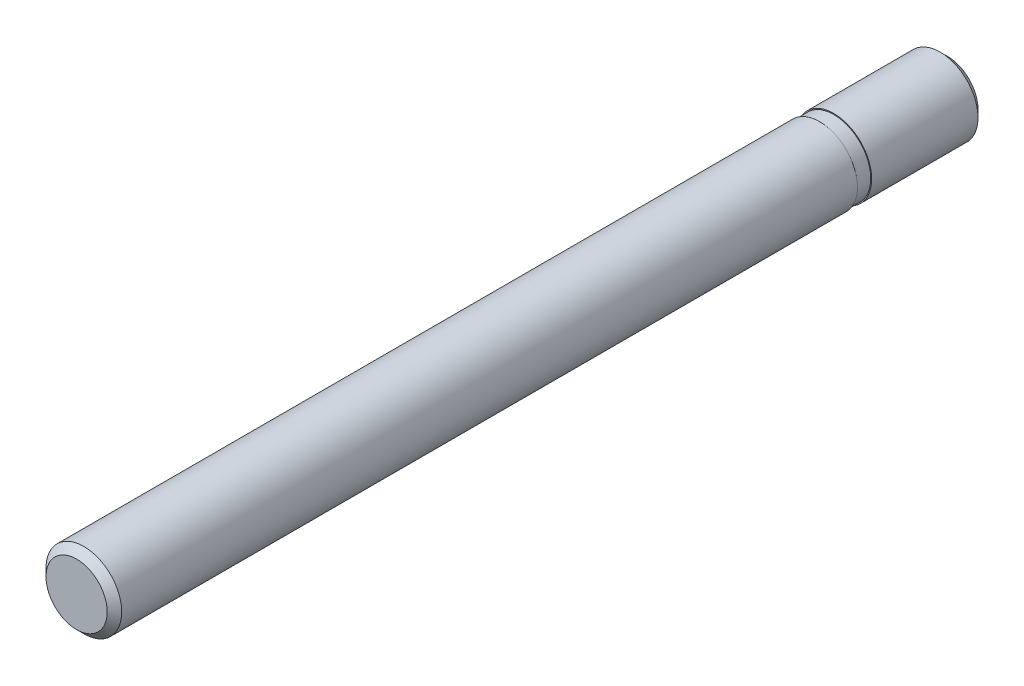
ISO-10303-21;
HEADER;
FILE_DESCRIPTION(('STEP AP214'),'2;1');
FILE_NAME('part.step','',(''),(''),'','','');
FILE_SCHEMA(('AUTOMOTIVE_DESIGN { 1 0 10303 214 1 1 1 1 }'));
ENDSEC;
DATA;
#1=APPLICATION_CONTEXT('core data for automotive mechanical design processes');
#2=APPLICATION_PROTOCOL_DEFINITION('international standard','automotive_design',2000,#1);
#3=PRODUCT_CONTEXT('',#1,'mechanical');
#4=PRODUCT('Part','Part','',(#3));
#5=PRODUCT_RELATED_PRODUCT_CATEGORY('part','',(#4));
#6=PRODUCT_DEFINITION_FORMATION('','',#4);
#7=PRODUCT_DEFINITION_CONTEXT('part definition',#1,'design');
#8=PRODUCT_DEFINITION('design','',#6,#7);
#9=PRODUCT_DEFINITION_SHAPE('','',#8);
#10=(LENGTH_UNIT() NAMED_UNIT(*) SI_UNIT(.MILLI.,.METRE.));
#11=(NAMED_UNIT(*) PLANE_ANGLE_UNIT() SI_UNIT($,.RADIAN.));
#12=(NAMED_UNIT(*) SI_UNIT($,.STERADIAN.) SOLID_ANGLE_UNIT());
#13=UNCERTAINTY_MEASURE_WITH_UNIT(LENGTH_MEASURE(1.E-05),#10,'distance_accuracy_value','');
#14=(GEOMETRIC_REPRESENTATION_CONTEXT(3) GLOBAL_UNCERTAINTY_ASSIGNED_CONTEXT((#13)) GLOBAL_UNIT_ASSIGNED_CONTEXT((#10,
#11,#12)) REPRESENTATION_CONTEXT('',''));
#15=CARTESIAN_POINT('',(0.,0.,0.));
#16=DIRECTION('',(0.,0.,1.));
#17=DIRECTION('',(1.,0.,0.));
#18=AXIS2_PLACEMENT_3D('',#15,#16,#17);
#19=CARTESIAN_POINT('',(0.,1.6165,-12.));
#20=DIRECTION('',(0.,0.,-1.));
#21=DIRECTION('',(-1.,0.,0.));
#22=AXIS2_PLACEMENT_3D('',#19,#20,#21);
#23=PLANE('',#22);
#24=CARTESIAN_POINT('',(0.,0.,-12.0000000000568));
#25=DIRECTION('',(0.,0.,1.));
#26=DIRECTION('',(1.,0.,0.));
#27=AXIS2_PLACEMENT_3D('',#24,#25,#26);
#28=CIRCLE('',#27,3.23300000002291);
#29=CARTESIAN_POINT('',(3.23300000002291,0.,-12.0000000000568));
#30=VERTEX_POINT('',#29);
#31=EDGE_CURVE('E19',#30,#30,#28,.T.);
#32=ORIENTED_EDGE('',*,*,#31,.F.);
#33=EDGE_LOOP('',(#32));
#34=FACE_BOUND('',#33,.T.);
#35=ADVANCED_FACE('F12',(#34),#23,.T.);
#36=CARTESIAN_POINT('',(0.,0.,-11.2330000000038));
#37=DIRECTION('',(0.,0.,1.));
#38=DIRECTION('',(1.,0.,0.));
#39=AXIS2_PLACEMENT_3D('',#36,#37,#38);
#40=CONICAL_SURFACE('',#39,4.00000000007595,0.785398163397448);
#41=CARTESIAN_POINT('',(0.,0.,-11.233));
#42=DIRECTION('',(0.,0.,1.));
#43=DIRECTION('',(1.,0.,0.));
#44=AXIS2_PLACEMENT_3D('',#41,#42,#43);
#45=CIRCLE('',#44,4.);
#46=CARTESIAN_POINT('',(4.,0.,-11.233));
#47=VERTEX_POINT('',#46);
#48=EDGE_CURVE('E23',#47,#47,#45,.T.);
#49=ORIENTED_EDGE('',*,*,#48,.F.);
#50=EDGE_LOOP('',(#49));
#51=FACE_BOUND('',#50,.T.);
#52=ORIENTED_EDGE('',*,*,#31,.T.);
#53=EDGE_LOOP('',(#52));
#54=FACE_BOUND('',#53,.T.);
#55=ADVANCED_FACE('F66',(#51,#54),#40,.T.);
#56=CARTESIAN_POINT('',(0.,0.,4.75));
#57=DIRECTION('',(0.,0.,1.));
#58=DIRECTION('',(1.,0.,0.));
#59=AXIS2_PLACEMENT_3D('',#56,#57,#58);
#60=CYLINDRICAL_SURFACE('',#59,4.);
#61=CARTESIAN_POINT('',(0.,0.,0.));
#62=DIRECTION('',(0.,0.,1.));
#63=DIRECTION('',(1.,0.,0.));
#64=AXIS2_PLACEMENT_3D('',#61,#62,#63);
#65=CIRCLE('',#64,4.);
#66=CARTESIAN_POINT('',(4.,0.,0.));
#67=VERTEX_POINT('',#66);
#68=EDGE_CURVE('E28',#67,#67,#65,.T.);
#69=ORIENTED_EDGE('',*,*,#68,.F.);
#70=EDGE_LOOP('',(#69));
#71=FACE_BOUND('',#70,.T.);
#72=ORIENTED_EDGE('',*,*,#48,.T.);
#73=EDGE_LOOP('',(#72));
#74=FACE_BOUND('',#73,.T.);
#75=ADVANCED_FACE('F72',(#71,#74),#60,.T.);
#76=CARTESIAN_POINT('',(0.,0.,0.));
#77=DIRECTION('',(0.,0.,1.));
#78=DIRECTION('',(1.,0.,0.));
#79=AXIS2_PLACEMENT_3D('',#76,#77,#78);
#80=PLANE('',#79);
#81=CARTESIAN_POINT('',(0.,0.,0.));
#82=DIRECTION('',(0.,0.,1.));
#83=DIRECTION('',(1.,0.,0.));
#84=AXIS2_PLACEMENT_3D('',#81,#82,#83);
#85=CIRCLE('',#84,3.9);
#86=CARTESIAN_POINT('',(3.9,0.,0.));
#87=VERTEX_POINT('',#86);
#88=EDGE_CURVE('E8',#87,#87,#85,.T.);
#89=ORIENTED_EDGE('',*,*,#88,.F.);
#90=EDGE_LOOP('',(#89));
#91=FACE_BOUND('',#90,.T.);
#92=ORIENTED_EDGE('',*,*,#68,.T.);
#93=EDGE_LOOP('',(#92));
#94=FACE_BOUND('',#93,.T.);
#95=ADVANCED_FACE('F77',(#91,#94),#80,.T.);
#96=CARTESIAN_POINT('',(0.,0.,-2.6671715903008));
#97=DIRECTION('',(0.,0.,-1.));
#98=DIRECTION('',(-1.,0.,0.));
#99=AXIS2_PLACEMENT_3D('',#96,#97,#98);
#100=CYLINDRICAL_SURFACE('',#99,3.9);
#101=CARTESIAN_POINT('',(0.,0.,1.5));
#102=DIRECTION('',(0.,0.,-1.));
#103=DIRECTION('',(-1.,0.,0.));
#104=AXIS2_PLACEMENT_3D('',#101,#102,#103);
#105=CIRCLE('',#104,3.9);
#106=CARTESIAN_POINT('',(-3.9,0.,1.5));
#107=VERTEX_POINT('',#106);
#108=EDGE_CURVE('E44',#107,#107,#105,.T.);
#109=ORIENTED_EDGE('',*,*,#108,.T.);
#110=EDGE_LOOP('',(#109));
#111=FACE_BOUND('',#110,.T.);
#112=ORIENTED_EDGE('',*,*,#88,.T.);
#113=EDGE_LOOP('',(#112));
#114=FACE_BOUND('',#113,.T.);
#115=ADVANCED_FACE('F51',(#111,#114),#100,.T.);
#116=CARTESIAN_POINT('',(0.,0.,80.));
#117=DIRECTION('',(0.,0.,1.));
#118=DIRECTION('',(1.,0.,0.));
#119=AXIS2_PLACEMENT_3D('',#116,#117,#118);
#120=PLANE('',#119);
#121=CARTESIAN_POINT('',(0.,0.,80.));
#122=DIRECTION('',(0.,0.,1.));
#123=DIRECTION('',(1.,0.,0.));
#124=AXIS2_PLACEMENT_3D('',#121,#122,#123);
#125=CIRCLE('',#124,3.233);
#126=CARTESIAN_POINT('',(3.233,0.,80.));
#127=VERTEX_POINT('',#126);
#128=EDGE_CURVE('E40',#127,#127,#125,.T.);
#129=ORIENTED_EDGE('',*,*,#128,.T.);
#130=EDGE_LOOP('',(#129));
#131=FACE_BOUND('',#130,.T.);
#132=ADVANCED_FACE('F85',(#131),#120,.T.);
#133=CARTESIAN_POINT('',(0.,0.,80.));
#134=DIRECTION('',(0.,0.,-1.));
#135=DIRECTION('',(-1.,0.,0.));
#136=AXIS2_PLACEMENT_3D('',#133,#134,#135);
#137=CONICAL_SURFACE('',#136,3.233,0.785398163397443);
#138=CARTESIAN_POINT('',(0.,0.,79.233));
#139=DIRECTION('',(0.,0.,1.));
#140=DIRECTION('',(1.,0.,0.));
#141=AXIS2_PLACEMENT_3D('',#138,#139,#140);
#142=CIRCLE('',#141,4.);
#143=CARTESIAN_POINT('',(4.,0.,79.233));
#144=VERTEX_POINT('',#143);
#145=EDGE_CURVE('E31',#144,#144,#142,.F.);
#146=ORIENTED_EDGE('',*,*,#145,.F.);
#147=EDGE_LOOP('',(#146));
#148=FACE_BOUND('',#147,.T.);
#149=ORIENTED_EDGE('',*,*,#128,.F.);
#150=EDGE_LOOP('',(#149));
#151=FACE_BOUND('',#150,.T.);
#152=ADVANCED_FACE('F62',(#148,#151),#137,.T.);
#153=CARTESIAN_POINT('',(0.,0.,4.75));
#154=DIRECTION('',(0.,0.,1.));
#155=DIRECTION('',(1.,0.,0.));
#156=AXIS2_PLACEMENT_3D('',#153,#154,#155);
#157=CYLINDRICAL_SURFACE('',#156,4.);
#158=CARTESIAN_POINT('',(0.,0.,1.5));
#159=DIRECTION('',(0.,0.,1.));
#160=DIRECTION('',(1.,0.,0.));
#161=AXIS2_PLACEMENT_3D('',#158,#159,#160);
#162=CIRCLE('',#161,4.);
#163=CARTESIAN_POINT('',(4.,0.,1.5));
#164=VERTEX_POINT('',#163);
#165=EDGE_CURVE('E35',#164,#164,#162,.T.);
#166=ORIENTED_EDGE('',*,*,#165,.T.);
#167=EDGE_LOOP('',(#166));
#168=FACE_BOUND('',#167,.T.);
#169=ORIENTED_EDGE('',*,*,#145,.T.);
#170=EDGE_LOOP('',(#169));
#171=FACE_BOUND('',#170,.T.);
#172=ADVANCED_FACE('F14',(#168,#171),#157,.T.);
#173=CARTESIAN_POINT('',(0.,0.,1.5));
#174=DIRECTION('',(0.,0.,1.));
#175=DIRECTION('',(1.,0.,0.));
#176=AXIS2_PLACEMENT_3D('',#173,#174,#175);
#177=PLANE('',#176);
#178=ORIENTED_EDGE('',*,*,#108,.F.);
#179=EDGE_LOOP('',(#178));
#180=FACE_BOUND('',#179,.T.);
#181=ORIENTED_EDGE('',*,*,#165,.F.);
#182=EDGE_LOOP('',(#181));
#183=FACE_BOUND('',#182,.T.);
#184=ADVANCED_FACE('F53',(#180,#183),#177,.F.);
#185=CLOSED_SHELL('',(#35,#55,#75,#95,#115,#132,#152,#172,#184));
#186=MANIFOLD_SOLID_BREP('B1',#185);
#187=ADVANCED_BREP_SHAPE_REPRESENTATION('',(#18,#186),#14);
#188=SHAPE_DEFINITION_REPRESENTATION(#9,#187);
ENDSEC;
END-ISO-10303-21;
